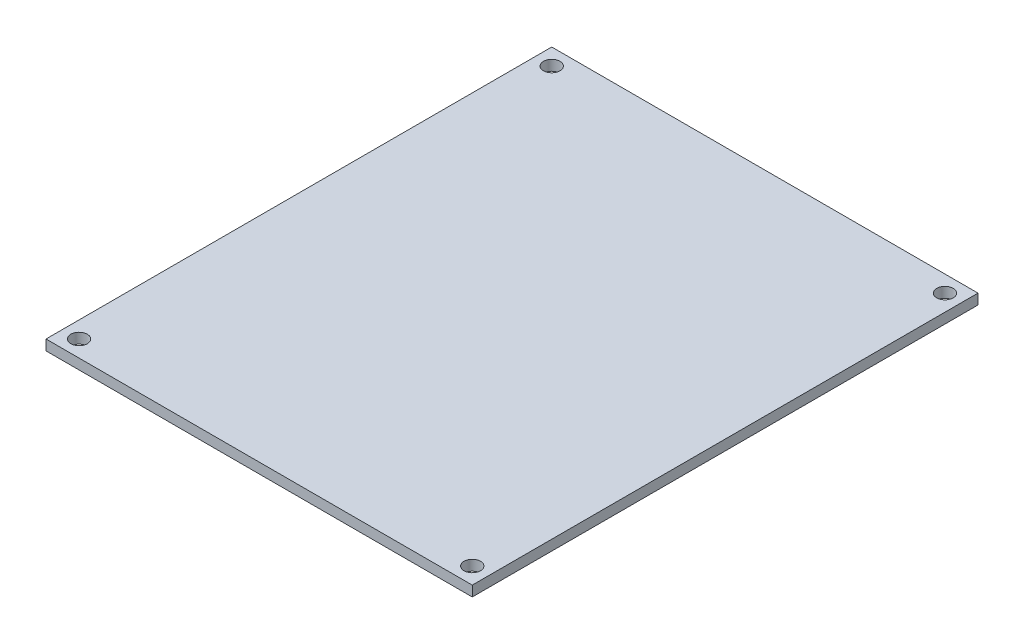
ISO-10303-21;
HEADER;
FILE_DESCRIPTION(('STEP AP214'),'2;1');
FILE_NAME('part.step','',(''),(''),'','','');
FILE_SCHEMA(('AUTOMOTIVE_DESIGN { 1 0 10303 214 1 1 1 1 }'));
ENDSEC;
DATA;
#1=APPLICATION_CONTEXT('core data for automotive mechanical design processes');
#2=APPLICATION_PROTOCOL_DEFINITION('international standard','automotive_design',2000,#1);
#3=PRODUCT_CONTEXT('',#1,'mechanical');
#4=PRODUCT('Part','Part','',(#3));
#5=PRODUCT_RELATED_PRODUCT_CATEGORY('part','',(#4));
#6=PRODUCT_DEFINITION_FORMATION('','',#4);
#7=PRODUCT_DEFINITION_CONTEXT('part definition',#1,'design');
#8=PRODUCT_DEFINITION('design','',#6,#7);
#9=PRODUCT_DEFINITION_SHAPE('','',#8);
#10=(LENGTH_UNIT() NAMED_UNIT(*) SI_UNIT(.MILLI.,.METRE.));
#11=(NAMED_UNIT(*) PLANE_ANGLE_UNIT() SI_UNIT($,.RADIAN.));
#12=(NAMED_UNIT(*) SI_UNIT($,.STERADIAN.) SOLID_ANGLE_UNIT());
#13=UNCERTAINTY_MEASURE_WITH_UNIT(LENGTH_MEASURE(1.E-05),#10,'distance_accuracy_value','');
#14=(GEOMETRIC_REPRESENTATION_CONTEXT(3) GLOBAL_UNCERTAINTY_ASSIGNED_CONTEXT((#13)) GLOBAL_UNIT_ASSIGNED_CONTEXT((#10,
#11,#12)) REPRESENTATION_CONTEXT('',''));
#15=CARTESIAN_POINT('',(0.,0.,0.));
#16=DIRECTION('',(0.,0.,1.));
#17=DIRECTION('',(1.,0.,0.));
#18=AXIS2_PLACEMENT_3D('',#15,#16,#17);
#19=CARTESIAN_POINT('',(-41.3,2.,-49.));
#20=DIRECTION('',(1.,0.,0.));
#21=DIRECTION('',(0.,0.,-1.));
#22=AXIS2_PLACEMENT_3D('',#19,#20,#21);
#23=PLANE('',#22);
#24=DIRECTION('',(0.,0.,1.));
#25=VECTOR('',#24,1.);
#26=CARTESIAN_POINT('',(-41.3,0.,-49.));
#27=LINE('',#26,#25);
#28=CARTESIAN_POINT('',(-41.3,0.,-49.));
#29=VERTEX_POINT('',#28);
#30=CARTESIAN_POINT('',(-41.3,0.,49.));
#31=VERTEX_POINT('',#30);
#32=EDGE_CURVE('E96',#29,#31,#27,.T.);
#33=ORIENTED_EDGE('',*,*,#32,.T.);
#34=DIRECTION('',(0.,-1.,0.));
#35=VECTOR('',#34,1.);
#36=CARTESIAN_POINT('',(-41.3,2.,49.));
#37=LINE('',#36,#35);
#38=CARTESIAN_POINT('',(-41.3,2.,49.));
#39=VERTEX_POINT('',#38);
#40=EDGE_CURVE('E11',#39,#31,#37,.T.);
#41=ORIENTED_EDGE('',*,*,#40,.F.);
#42=DIRECTION('',(0.,0.,1.));
#43=VECTOR('',#42,1.);
#44=CARTESIAN_POINT('',(-41.3,2.,-49.));
#45=LINE('',#44,#43);
#46=CARTESIAN_POINT('',(-41.3,2.,-49.));
#47=VERTEX_POINT('',#46);
#48=EDGE_CURVE('E84',#47,#39,#45,.T.);
#49=ORIENTED_EDGE('',*,*,#48,.F.);
#50=DIRECTION('',(0.,-1.,0.));
#51=VECTOR('',#50,1.);
#52=CARTESIAN_POINT('',(-41.3,2.,-49.));
#53=LINE('',#52,#51);
#54=EDGE_CURVE('E92',#47,#29,#53,.T.);
#55=ORIENTED_EDGE('',*,*,#54,.T.);
#56=EDGE_LOOP('',(#33,#41,#49,#55));
#57=FACE_BOUND('',#56,.T.);
#58=ADVANCED_FACE('F33',(#57),#23,.F.);
#59=CARTESIAN_POINT('',(41.3,2.,49.));
#60=DIRECTION('',(0.,0.,-1.));
#61=DIRECTION('',(-1.,0.,0.));
#62=AXIS2_PLACEMENT_3D('',#59,#60,#61);
#63=PLANE('',#62);
#64=DIRECTION('',(1.,0.,0.));
#65=VECTOR('',#64,1.);
#66=CARTESIAN_POINT('',(41.3,0.,49.));
#67=LINE('',#66,#65);
#68=CARTESIAN_POINT('',(41.3,0.,49.));
#69=VERTEX_POINT('',#68);
#70=EDGE_CURVE('E88',#31,#69,#67,.T.);
#71=ORIENTED_EDGE('',*,*,#70,.T.);
#72=DIRECTION('',(0.,-1.,0.));
#73=VECTOR('',#72,1.);
#74=CARTESIAN_POINT('',(41.3,2.,49.));
#75=LINE('',#74,#73);
#76=CARTESIAN_POINT('',(41.3,2.,49.));
#77=VERTEX_POINT('',#76);
#78=EDGE_CURVE('E41',#77,#69,#75,.T.);
#79=ORIENTED_EDGE('',*,*,#78,.F.);
#80=DIRECTION('',(1.,0.,0.));
#81=VECTOR('',#80,1.);
#82=CARTESIAN_POINT('',(41.3,2.,49.));
#83=LINE('',#82,#81);
#84=EDGE_CURVE('E79',#39,#77,#83,.T.);
#85=ORIENTED_EDGE('',*,*,#84,.F.);
#86=ORIENTED_EDGE('',*,*,#40,.T.);
#87=EDGE_LOOP('',(#71,#79,#85,#86));
#88=FACE_BOUND('',#87,.T.);
#89=ADVANCED_FACE('F87',(#88),#63,.F.);
#90=CARTESIAN_POINT('',(41.3,2.,-49.));
#91=DIRECTION('',(-1.,0.,0.));
#92=DIRECTION('',(0.,0.,1.));
#93=AXIS2_PLACEMENT_3D('',#90,#91,#92);
#94=PLANE('',#93);
#95=DIRECTION('',(0.,0.,-1.));
#96=VECTOR('',#95,1.);
#97=CARTESIAN_POINT('',(41.3,0.,-49.));
#98=LINE('',#97,#96);
#99=CARTESIAN_POINT('',(41.3,0.,-49.));
#100=VERTEX_POINT('',#99);
#101=EDGE_CURVE('E66',#69,#100,#98,.T.);
#102=ORIENTED_EDGE('',*,*,#101,.T.);
#103=DIRECTION('',(0.,-1.,0.));
#104=VECTOR('',#103,1.);
#105=CARTESIAN_POINT('',(41.3,2.,-49.));
#106=LINE('',#105,#104);
#107=CARTESIAN_POINT('',(41.3,2.,-49.));
#108=VERTEX_POINT('',#107);
#109=EDGE_CURVE('E89',#108,#100,#106,.T.);
#110=ORIENTED_EDGE('',*,*,#109,.F.);
#111=DIRECTION('',(0.,0.,-1.));
#112=VECTOR('',#111,1.);
#113=CARTESIAN_POINT('',(41.3,2.,-49.));
#114=LINE('',#113,#112);
#115=EDGE_CURVE('E82',#77,#108,#114,.T.);
#116=ORIENTED_EDGE('',*,*,#115,.F.);
#117=ORIENTED_EDGE('',*,*,#78,.T.);
#118=EDGE_LOOP('',(#102,#110,#116,#117));
#119=FACE_BOUND('',#118,.T.);
#120=ADVANCED_FACE('F90',(#119),#94,.F.);
#121=CARTESIAN_POINT('',(41.3,2.,-49.));
#122=DIRECTION('',(0.,0.,1.));
#123=DIRECTION('',(1.,0.,0.));
#124=AXIS2_PLACEMENT_3D('',#121,#122,#123);
#125=PLANE('',#124);
#126=DIRECTION('',(-1.,0.,0.));
#127=VECTOR('',#126,1.);
#128=CARTESIAN_POINT('',(41.3,0.,-49.));
#129=LINE('',#128,#127);
#130=EDGE_CURVE('E72',#100,#29,#129,.T.);
#131=ORIENTED_EDGE('',*,*,#130,.T.);
#132=ORIENTED_EDGE('',*,*,#54,.F.);
#133=DIRECTION('',(-1.,0.,0.));
#134=VECTOR('',#133,1.);
#135=CARTESIAN_POINT('',(41.3,2.,-49.));
#136=LINE('',#135,#134);
#137=EDGE_CURVE('E49',#108,#47,#136,.T.);
#138=ORIENTED_EDGE('',*,*,#137,.F.);
#139=ORIENTED_EDGE('',*,*,#109,.T.);
#140=EDGE_LOOP('',(#131,#132,#138,#139));
#141=FACE_BOUND('',#140,.T.);
#142=ADVANCED_FACE('F104',(#141),#125,.F.);
#143=CARTESIAN_POINT('',(0.,2.,0.));
#144=DIRECTION('',(0.,-1.,0.));
#145=DIRECTION('',(0.,0.,-1.));
#146=AXIS2_PLACEMENT_3D('',#143,#144,#145);
#147=PLANE('',#146);
#148=CARTESIAN_POINT('',(-38.1,2.,-45.8));
#149=DIRECTION('',(0.,1.,0.));
#150=DIRECTION('',(0.,0.,1.));
#151=AXIS2_PLACEMENT_3D('',#148,#149,#150);
#152=CIRCLE('',#151,1.59999999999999);
#153=CARTESIAN_POINT('',(-38.1,2.,-44.2));
#154=VERTEX_POINT('',#153);
#155=EDGE_CURVE('E130',#154,#154,#152,.T.);
#156=ORIENTED_EDGE('',*,*,#155,.F.);
#157=EDGE_LOOP('',(#156));
#158=FACE_BOUND('',#157,.T.);
#159=CARTESIAN_POINT('',(38.1,2.,-45.8));
#160=DIRECTION('',(0.,1.,0.));
#161=DIRECTION('',(0.,0.,1.));
#162=AXIS2_PLACEMENT_3D('',#159,#160,#161);
#163=CIRCLE('',#162,1.59999999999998);
#164=CARTESIAN_POINT('',(38.1,2.,-44.2));
#165=VERTEX_POINT('',#164);
#166=EDGE_CURVE('E124',#165,#165,#163,.T.);
#167=ORIENTED_EDGE('',*,*,#166,.F.);
#168=EDGE_LOOP('',(#167));
#169=FACE_BOUND('',#168,.T.);
#170=CARTESIAN_POINT('',(38.1,2.,45.8));
#171=DIRECTION('',(0.,1.,0.));
#172=DIRECTION('',(0.,0.,1.));
#173=AXIS2_PLACEMENT_3D('',#170,#171,#172);
#174=CIRCLE('',#173,1.59999999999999);
#175=CARTESIAN_POINT('',(38.1,2.,47.4));
#176=VERTEX_POINT('',#175);
#177=EDGE_CURVE('E118',#176,#176,#174,.T.);
#178=ORIENTED_EDGE('',*,*,#177,.F.);
#179=EDGE_LOOP('',(#178));
#180=FACE_BOUND('',#179,.T.);
#181=CARTESIAN_POINT('',(-38.1,2.,45.8));
#182=DIRECTION('',(0.,1.,0.));
#183=DIRECTION('',(0.,0.,1.));
#184=AXIS2_PLACEMENT_3D('',#181,#182,#183);
#185=CIRCLE('',#184,1.59999999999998);
#186=CARTESIAN_POINT('',(-38.1,2.,47.4));
#187=VERTEX_POINT('',#186);
#188=EDGE_CURVE('E112',#187,#187,#185,.T.);
#189=ORIENTED_EDGE('',*,*,#188,.F.);
#190=EDGE_LOOP('',(#189));
#191=FACE_BOUND('',#190,.T.);
#192=ORIENTED_EDGE('',*,*,#48,.T.);
#193=ORIENTED_EDGE('',*,*,#84,.T.);
#194=ORIENTED_EDGE('',*,*,#115,.T.);
#195=ORIENTED_EDGE('',*,*,#137,.T.);
#196=EDGE_LOOP('',(#192,#193,#194,#195));
#197=FACE_BOUND('',#196,.T.);
#198=ADVANCED_FACE('F80',(#158,#169,#180,#191,#197),#147,.F.);
#199=CARTESIAN_POINT('',(0.,0.,0.));
#200=DIRECTION('',(0.,-1.,0.));
#201=DIRECTION('',(0.,0.,-1.));
#202=AXIS2_PLACEMENT_3D('',#199,#200,#201);
#203=PLANE('',#202);
#204=CARTESIAN_POINT('',(-38.1,0.,-45.8));
#205=DIRECTION('',(0.,1.,0.));
#206=DIRECTION('',(0.,0.,1.));
#207=AXIS2_PLACEMENT_3D('',#204,#205,#206);
#208=CIRCLE('',#207,1.59999999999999);
#209=CARTESIAN_POINT('',(-38.1,0.,-44.2));
#210=VERTEX_POINT('',#209);
#211=EDGE_CURVE('E127',#210,#210,#208,.T.);
#212=ORIENTED_EDGE('',*,*,#211,.T.);
#213=EDGE_LOOP('',(#212));
#214=FACE_BOUND('',#213,.T.);
#215=CARTESIAN_POINT('',(38.1,0.,-45.8));
#216=DIRECTION('',(0.,1.,0.));
#217=DIRECTION('',(0.,0.,1.));
#218=AXIS2_PLACEMENT_3D('',#215,#216,#217);
#219=CIRCLE('',#218,1.59999999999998);
#220=CARTESIAN_POINT('',(38.1,0.,-44.2));
#221=VERTEX_POINT('',#220);
#222=EDGE_CURVE('E121',#221,#221,#219,.T.);
#223=ORIENTED_EDGE('',*,*,#222,.T.);
#224=EDGE_LOOP('',(#223));
#225=FACE_BOUND('',#224,.T.);
#226=CARTESIAN_POINT('',(38.1,0.,45.8));
#227=DIRECTION('',(0.,1.,0.));
#228=DIRECTION('',(0.,0.,1.));
#229=AXIS2_PLACEMENT_3D('',#226,#227,#228);
#230=CIRCLE('',#229,1.59999999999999);
#231=CARTESIAN_POINT('',(38.1,0.,47.4));
#232=VERTEX_POINT('',#231);
#233=EDGE_CURVE('E115',#232,#232,#230,.T.);
#234=ORIENTED_EDGE('',*,*,#233,.T.);
#235=EDGE_LOOP('',(#234));
#236=FACE_BOUND('',#235,.T.);
#237=CARTESIAN_POINT('',(-38.1,0.,45.8));
#238=DIRECTION('',(0.,1.,0.));
#239=DIRECTION('',(0.,0.,1.));
#240=AXIS2_PLACEMENT_3D('',#237,#238,#239);
#241=CIRCLE('',#240,1.59999999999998);
#242=CARTESIAN_POINT('',(-38.1,0.,47.4));
#243=VERTEX_POINT('',#242);
#244=EDGE_CURVE('E99',#243,#243,#241,.T.);
#245=ORIENTED_EDGE('',*,*,#244,.T.);
#246=EDGE_LOOP('',(#245));
#247=FACE_BOUND('',#246,.T.);
#248=ORIENTED_EDGE('',*,*,#32,.F.);
#249=ORIENTED_EDGE('',*,*,#130,.F.);
#250=ORIENTED_EDGE('',*,*,#101,.F.);
#251=ORIENTED_EDGE('',*,*,#70,.F.);
#252=EDGE_LOOP('',(#248,#249,#250,#251));
#253=FACE_BOUND('',#252,.T.);
#254=ADVANCED_FACE('F107',(#214,#225,#236,#247,#253),#203,.T.);
#255=CARTESIAN_POINT('',(-38.1,2.,45.8));
#256=DIRECTION('',(0.,1.,0.));
#257=DIRECTION('',(0.,0.,1.));
#258=AXIS2_PLACEMENT_3D('',#255,#256,#257);
#259=CYLINDRICAL_SURFACE('',#258,1.59999999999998);
#260=ORIENTED_EDGE('',*,*,#244,.F.);
#261=EDGE_LOOP('',(#260));
#262=FACE_BOUND('',#261,.T.);
#263=ORIENTED_EDGE('',*,*,#188,.T.);
#264=EDGE_LOOP('',(#263));
#265=FACE_BOUND('',#264,.T.);
#266=ADVANCED_FACE('F145',(#262,#265),#259,.F.);
#267=CARTESIAN_POINT('',(38.1,2.,45.8));
#268=DIRECTION('',(0.,1.,0.));
#269=DIRECTION('',(0.,0.,1.));
#270=AXIS2_PLACEMENT_3D('',#267,#268,#269);
#271=CYLINDRICAL_SURFACE('',#270,1.59999999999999);
#272=ORIENTED_EDGE('',*,*,#233,.F.);
#273=EDGE_LOOP('',(#272));
#274=FACE_BOUND('',#273,.T.);
#275=ORIENTED_EDGE('',*,*,#177,.T.);
#276=EDGE_LOOP('',(#275));
#277=FACE_BOUND('',#276,.T.);
#278=ADVANCED_FACE('F147',(#274,#277),#271,.F.);
#279=CARTESIAN_POINT('',(38.1,2.,-45.8));
#280=DIRECTION('',(0.,1.,0.));
#281=DIRECTION('',(0.,0.,1.));
#282=AXIS2_PLACEMENT_3D('',#279,#280,#281);
#283=CYLINDRICAL_SURFACE('',#282,1.59999999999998);
#284=ORIENTED_EDGE('',*,*,#222,.F.);
#285=EDGE_LOOP('',(#284));
#286=FACE_BOUND('',#285,.T.);
#287=ORIENTED_EDGE('',*,*,#166,.T.);
#288=EDGE_LOOP('',(#287));
#289=FACE_BOUND('',#288,.T.);
#290=ADVANCED_FACE('F154',(#286,#289),#283,.F.);
#291=CARTESIAN_POINT('',(-38.1,2.,-45.8));
#292=DIRECTION('',(0.,1.,0.));
#293=DIRECTION('',(0.,0.,1.));
#294=AXIS2_PLACEMENT_3D('',#291,#292,#293);
#295=CYLINDRICAL_SURFACE('',#294,1.59999999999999);
#296=ORIENTED_EDGE('',*,*,#211,.F.);
#297=EDGE_LOOP('',(#296));
#298=FACE_BOUND('',#297,.T.);
#299=ORIENTED_EDGE('',*,*,#155,.T.);
#300=EDGE_LOOP('',(#299));
#301=FACE_BOUND('',#300,.T.);
#302=ADVANCED_FACE('F134',(#298,#301),#295,.F.);
#303=CLOSED_SHELL('',(#58,#89,#120,#142,#198,#254,#266,#278,#290,#302));
#304=MANIFOLD_SOLID_BREP('B2',#303);
#305=ADVANCED_BREP_SHAPE_REPRESENTATION('',(#18,#304),#14);
#306=SHAPE_DEFINITION_REPRESENTATION(#9,#305);
ENDSEC;
END-ISO-10303-21;
